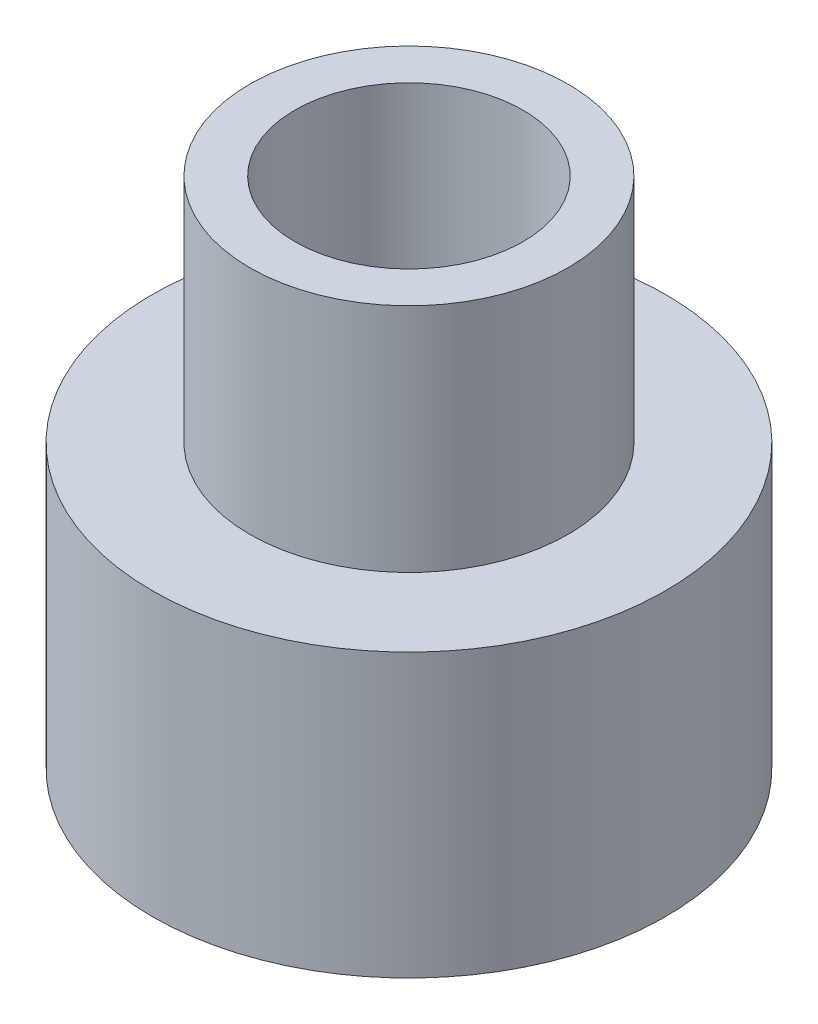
ISO-10303-21;
HEADER;
FILE_DESCRIPTION(('STEP AP214'),'2;1');
FILE_NAME('part.step','',(''),(''),'','','');
FILE_SCHEMA(('AUTOMOTIVE_DESIGN { 1 0 10303 214 1 1 1 1 }'));
ENDSEC;
DATA;
#1=APPLICATION_CONTEXT('core data for automotive mechanical design processes');
#2=APPLICATION_PROTOCOL_DEFINITION('international standard','automotive_design',2000,#1);
#3=PRODUCT_CONTEXT('',#1,'mechanical');
#4=PRODUCT('Part','Part','',(#3));
#5=PRODUCT_RELATED_PRODUCT_CATEGORY('part','',(#4));
#6=PRODUCT_DEFINITION_FORMATION('','',#4);
#7=PRODUCT_DEFINITION_CONTEXT('part definition',#1,'design');
#8=PRODUCT_DEFINITION('design','',#6,#7);
#9=PRODUCT_DEFINITION_SHAPE('','',#8);
#10=(LENGTH_UNIT() NAMED_UNIT(*) SI_UNIT(.MILLI.,.METRE.));
#11=(NAMED_UNIT(*) PLANE_ANGLE_UNIT() SI_UNIT($,.RADIAN.));
#12=(NAMED_UNIT(*) SI_UNIT($,.STERADIAN.) SOLID_ANGLE_UNIT());
#13=UNCERTAINTY_MEASURE_WITH_UNIT(LENGTH_MEASURE(1.E-05),#10,'distance_accuracy_value','');
#14=(GEOMETRIC_REPRESENTATION_CONTEXT(3) GLOBAL_UNCERTAINTY_ASSIGNED_CONTEXT((#13)) GLOBAL_UNIT_ASSIGNED_CONTEXT((#10,
#11,#12)) REPRESENTATION_CONTEXT('',''));
#15=CARTESIAN_POINT('',(0.,0.,0.));
#16=DIRECTION('',(0.,0.,1.));
#17=DIRECTION('',(1.,0.,0.));
#18=AXIS2_PLACEMENT_3D('',#15,#16,#17);
#19=CARTESIAN_POINT('',(0.,2.2,0.));
#20=DIRECTION('',(0.,-1.,0.));
#21=DIRECTION('',(0.,0.,-1.));
#22=AXIS2_PLACEMENT_3D('',#19,#20,#21);
#23=CYLINDRICAL_SURFACE('',#22,2.);
#24=CARTESIAN_POINT('',(0.,2.2,0.));
#25=DIRECTION('',(0.,1.,0.));
#26=DIRECTION('',(0.,0.,1.));
#27=AXIS2_PLACEMENT_3D('',#24,#25,#26);
#28=CIRCLE('',#27,2.);
#29=CARTESIAN_POINT('',(0.,2.2,2.));
#30=VERTEX_POINT('',#29);
#31=EDGE_CURVE('E42',#30,#30,#28,.T.);
#32=ORIENTED_EDGE('',*,*,#31,.F.);
#33=EDGE_LOOP('',(#32));
#34=FACE_BOUND('',#33,.T.);
#35=CARTESIAN_POINT('',(0.,0.,0.));
#36=DIRECTION('',(0.,1.,0.));
#37=DIRECTION('',(0.,0.,1.));
#38=AXIS2_PLACEMENT_3D('',#35,#36,#37);
#39=CIRCLE('',#38,2.);
#40=CARTESIAN_POINT('',(0.,0.,2.));
#41=VERTEX_POINT('',#40);
#42=EDGE_CURVE('E38',#41,#41,#39,.T.);
#43=ORIENTED_EDGE('',*,*,#42,.T.);
#44=EDGE_LOOP('',(#43));
#45=FACE_BOUND('',#44,.T.);
#46=ADVANCED_FACE('F35',(#34,#45),#23,.T.);
#47=CARTESIAN_POINT('',(0.,2.2,0.));
#48=DIRECTION('',(0.,1.,0.));
#49=DIRECTION('',(0.,0.,1.));
#50=AXIS2_PLACEMENT_3D('',#47,#48,#49);
#51=PLANE('',#50);
#52=CARTESIAN_POINT('',(0.,2.2,0.));
#53=DIRECTION('',(0.,1.,0.));
#54=DIRECTION('',(0.,0.,1.));
#55=AXIS2_PLACEMENT_3D('',#52,#53,#54);
#56=CIRCLE('',#55,1.24);
#57=CARTESIAN_POINT('',(0.,2.2,1.24));
#58=VERTEX_POINT('',#57);
#59=EDGE_CURVE('E11',#58,#58,#56,.T.);
#60=ORIENTED_EDGE('',*,*,#59,.F.);
#61=EDGE_LOOP('',(#60));
#62=FACE_BOUND('',#61,.T.);
#63=ORIENTED_EDGE('',*,*,#31,.T.);
#64=EDGE_LOOP('',(#63));
#65=FACE_BOUND('',#64,.T.);
#66=ADVANCED_FACE('F73',(#62,#65),#51,.T.);
#67=CARTESIAN_POINT('',(0.,0.,0.));
#68=DIRECTION('',(0.,1.,0.));
#69=DIRECTION('',(0.,0.,1.));
#70=AXIS2_PLACEMENT_3D('',#67,#68,#69);
#71=PLANE('',#70);
#72=ORIENTED_EDGE('',*,*,#42,.F.);
#73=EDGE_LOOP('',(#72));
#74=FACE_BOUND('',#73,.T.);
#75=ADVANCED_FACE('F70',(#74),#71,.F.);
#76=CARTESIAN_POINT('',(0.,4.,0.));
#77=DIRECTION('',(0.,-1.,0.));
#78=DIRECTION('',(0.,0.,-1.));
#79=AXIS2_PLACEMENT_3D('',#76,#77,#78);
#80=CYLINDRICAL_SURFACE('',#79,1.24);
#81=CARTESIAN_POINT('',(0.,4.,0.));
#82=DIRECTION('',(0.,1.,0.));
#83=DIRECTION('',(0.,0.,1.));
#84=AXIS2_PLACEMENT_3D('',#81,#82,#83);
#85=CIRCLE('',#84,1.24);
#86=CARTESIAN_POINT('',(0.,4.,1.24));
#87=VERTEX_POINT('',#86);
#88=EDGE_CURVE('E56',#87,#87,#85,.T.);
#89=ORIENTED_EDGE('',*,*,#88,.F.);
#90=EDGE_LOOP('',(#89));
#91=FACE_BOUND('',#90,.T.);
#92=ORIENTED_EDGE('',*,*,#59,.T.);
#93=EDGE_LOOP('',(#92));
#94=FACE_BOUND('',#93,.T.);
#95=ADVANCED_FACE('F72',(#91,#94),#80,.T.);
#96=CARTESIAN_POINT('',(0.,4.,0.));
#97=DIRECTION('',(0.,1.,0.));
#98=DIRECTION('',(0.,0.,1.));
#99=AXIS2_PLACEMENT_3D('',#96,#97,#98);
#100=PLANE('',#99);
#101=CARTESIAN_POINT('',(0.,4.,0.));
#102=DIRECTION('',(0.,1.,0.));
#103=DIRECTION('',(0.,0.,1.));
#104=AXIS2_PLACEMENT_3D('',#101,#102,#103);
#105=CIRCLE('',#104,0.888999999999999);
#106=CARTESIAN_POINT('',(0.,4.,0.888999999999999));
#107=VERTEX_POINT('',#106);
#108=EDGE_CURVE('E57',#107,#107,#105,.T.);
#109=ORIENTED_EDGE('',*,*,#108,.F.);
#110=EDGE_LOOP('',(#109));
#111=FACE_BOUND('',#110,.T.);
#112=ORIENTED_EDGE('',*,*,#88,.T.);
#113=EDGE_LOOP('',(#112));
#114=FACE_BOUND('',#113,.T.);
#115=ADVANCED_FACE('F50',(#111,#114),#100,.T.);
#116=CARTESIAN_POINT('',(0.,0.825,0.));
#117=DIRECTION('',(0.,1.,0.));
#118=DIRECTION('',(0.,0.,1.));
#119=AXIS2_PLACEMENT_3D('',#116,#117,#118);
#120=CONICAL_SURFACE('',#119,0.888999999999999,1.02974425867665);
#121=CARTESIAN_POINT('',(0.,0.290834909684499,0.));
#122=VERTEX_POINT('',#121);
#123=VERTEX_LOOP('',#122);
#124=FACE_BOUND('',#123,.T.);
#125=CARTESIAN_POINT('',(0.,0.825,0.));
#126=DIRECTION('',(0.,1.,0.));
#127=DIRECTION('',(0.,0.,1.));
#128=AXIS2_PLACEMENT_3D('',#125,#126,#127);
#129=CIRCLE('',#128,0.888999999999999);
#130=CARTESIAN_POINT('',(0.,0.825,0.888999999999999));
#131=VERTEX_POINT('',#130);
#132=EDGE_CURVE('E54',#131,#131,#129,.T.);
#133=ORIENTED_EDGE('',*,*,#132,.T.);
#134=EDGE_LOOP('',(#133));
#135=FACE_BOUND('',#134,.T.);
#136=ADVANCED_FACE('F46',(#124,#135),#120,.F.);
#137=CARTESIAN_POINT('',(0.,4.,0.));
#138=DIRECTION('',(0.,1.,0.));
#139=DIRECTION('',(0.,0.,1.));
#140=AXIS2_PLACEMENT_3D('',#137,#138,#139);
#141=CYLINDRICAL_SURFACE('',#140,0.888999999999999);
#142=ORIENTED_EDGE('',*,*,#132,.F.);
#143=EDGE_LOOP('',(#142));
#144=FACE_BOUND('',#143,.T.);
#145=ORIENTED_EDGE('',*,*,#108,.T.);
#146=EDGE_LOOP('',(#145));
#147=FACE_BOUND('',#146,.T.);
#148=ADVANCED_FACE('F49',(#144,#147),#141,.F.);
#149=CLOSED_SHELL('',(#46,#66,#75,#95,#115,#136,#148));
#150=MANIFOLD_SOLID_BREP('B2',#149);
#151=ADVANCED_BREP_SHAPE_REPRESENTATION('',(#18,#150),#14);
#152=SHAPE_DEFINITION_REPRESENTATION(#9,#151);
ENDSEC;
END-ISO-10303-21;
